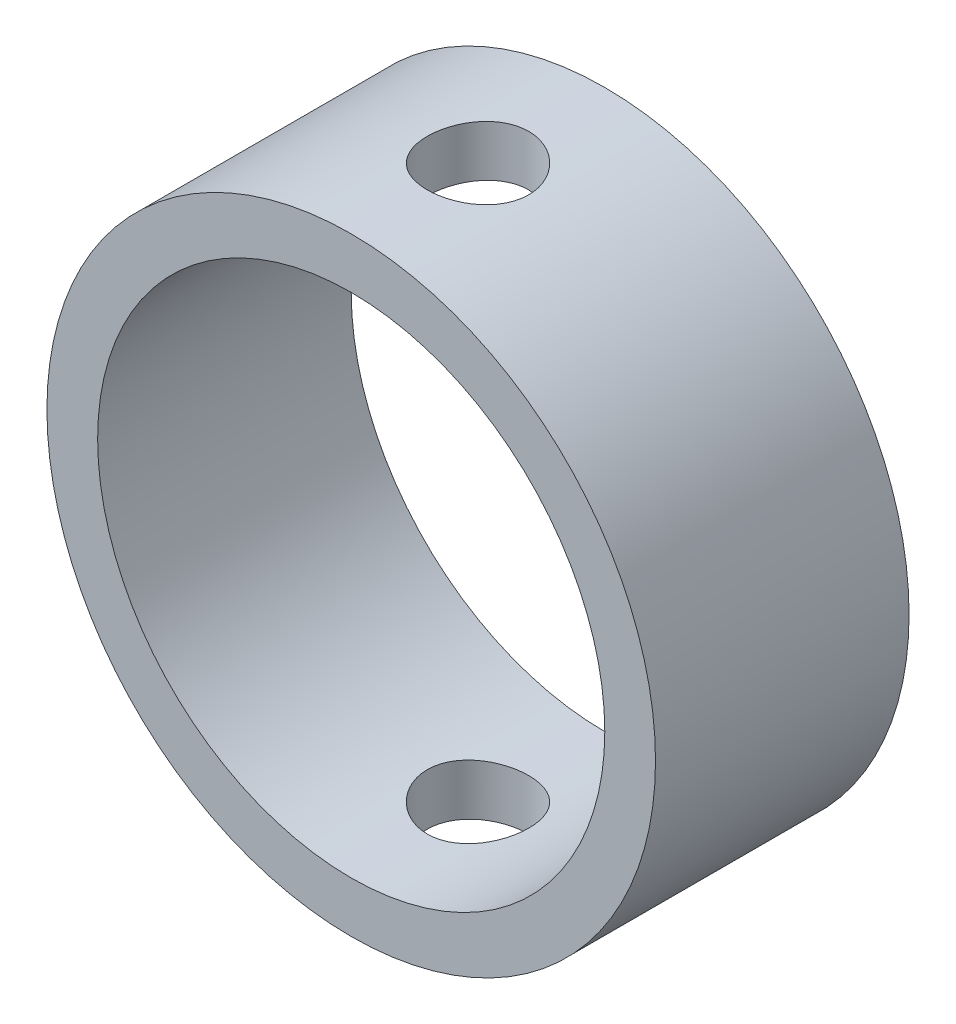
ISO-10303-21;
HEADER;
FILE_DESCRIPTION(('STEP AP214'),'2;1');
FILE_NAME('part.step','',(''),(''),'','','');
FILE_SCHEMA(('AUTOMOTIVE_DESIGN { 1 0 10303 214 1 1 1 1 }'));
ENDSEC;
DATA;
#1=APPLICATION_CONTEXT('core data for automotive mechanical design processes');
#2=APPLICATION_PROTOCOL_DEFINITION('international standard','automotive_design',2000,#1);
#3=PRODUCT_CONTEXT('',#1,'mechanical');
#4=PRODUCT('Part','Part','',(#3));
#5=PRODUCT_RELATED_PRODUCT_CATEGORY('part','',(#4));
#6=PRODUCT_DEFINITION_FORMATION('','',#4);
#7=PRODUCT_DEFINITION_CONTEXT('part definition',#1,'design');
#8=PRODUCT_DEFINITION('design','',#6,#7);
#9=PRODUCT_DEFINITION_SHAPE('','',#8);
#10=(LENGTH_UNIT() NAMED_UNIT(*) SI_UNIT(.MILLI.,.METRE.));
#11=(NAMED_UNIT(*) PLANE_ANGLE_UNIT() SI_UNIT($,.RADIAN.));
#12=(NAMED_UNIT(*) SI_UNIT($,.STERADIAN.) SOLID_ANGLE_UNIT());
#13=UNCERTAINTY_MEASURE_WITH_UNIT(LENGTH_MEASURE(1.E-05),#10,'distance_accuracy_value','');
#14=(GEOMETRIC_REPRESENTATION_CONTEXT(3) GLOBAL_UNCERTAINTY_ASSIGNED_CONTEXT((#13)) GLOBAL_UNIT_ASSIGNED_CONTEXT((#10,
#11,#12)) REPRESENTATION_CONTEXT('',''));
#15=CARTESIAN_POINT('',(0.,0.,0.));
#16=DIRECTION('',(0.,0.,1.));
#17=DIRECTION('',(1.,0.,0.));
#18=AXIS2_PLACEMENT_3D('',#15,#16,#17);
#19=CARTESIAN_POINT('',(0.,0.,5.));
#20=DIRECTION('',(0.,0.,-1.));
#21=DIRECTION('',(-1.,0.,0.));
#22=AXIS2_PLACEMENT_3D('',#19,#20,#21);
#23=CYLINDRICAL_SURFACE('',#22,6.);
#24=CARTESIAN_POINT('',(0.,-6.,3.5));
#25=CARTESIAN_POINT('',(0.0557563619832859,-5.9999990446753,3.49999776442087));
#26=CARTESIAN_POINT('',(0.111543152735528,-5.99921471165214,3.49532109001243));
#27=CARTESIAN_POINT('',(0.221552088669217,-5.99616137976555,3.47674573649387));
#28=CARTESIAN_POINT('',(0.275772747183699,-5.99389101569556,3.46283857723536));
#29=CARTESIAN_POINT('',(0.381041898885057,-5.9881202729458,3.4262338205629));
#30=CARTESIAN_POINT('',(0.43209294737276,-5.98462090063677,3.40354341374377));
#31=CARTESIAN_POINT('',(0.529656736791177,-5.97677690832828,3.35003508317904));
#32=CARTESIAN_POINT('',(0.576169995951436,-5.97243238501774,3.3192180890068));
#33=CARTESIAN_POINT('',(0.663789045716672,-5.96333326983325,3.25001796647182));
#34=CARTESIAN_POINT('',(0.704845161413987,-5.95857548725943,3.21157235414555));
#35=CARTESIAN_POINT('',(0.779955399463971,-5.94921050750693,3.12834081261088));
#36=CARTESIAN_POINT('',(0.814009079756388,-5.94460331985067,3.08355448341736));
#37=CARTESIAN_POINT('',(0.874346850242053,-5.93603026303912,2.98857161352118));
#38=CARTESIAN_POINT('',(0.900581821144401,-5.93206851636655,2.9383434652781));
#39=CARTESIAN_POINT('',(0.944223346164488,-5.9252791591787,2.83411617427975));
#40=CARTESIAN_POINT('',(0.961630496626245,-5.92245147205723,2.78011728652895));
#41=CARTESIAN_POINT('',(0.986965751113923,-5.91828214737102,2.67040789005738));
#42=CARTESIAN_POINT('',(0.994979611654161,-5.9169270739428,2.61471770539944));
#43=CARTESIAN_POINT('',(1.00156669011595,-5.9158157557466,2.50276788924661));
#44=CARTESIAN_POINT('',(1.0001405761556,-5.91605939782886,2.44650829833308));
#45=CARTESIAN_POINT('',(0.987958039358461,-5.91810571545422,2.33562885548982));
#46=CARTESIAN_POINT('',(0.977297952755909,-5.91989229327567,2.28099807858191));
#47=CARTESIAN_POINT('',(0.947101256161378,-5.92479798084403,2.17431147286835));
#48=CARTESIAN_POINT('',(0.927564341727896,-5.92791713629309,2.12225573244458));
#49=CARTESIAN_POINT('',(0.880070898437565,-5.9351539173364,2.02190847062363));
#50=CARTESIAN_POINT('',(0.852074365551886,-5.9392762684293,1.97363623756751));
#51=CARTESIAN_POINT('',(0.788484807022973,-5.94805167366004,1.88243823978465));
#52=CARTESIAN_POINT('',(0.752891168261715,-5.95270477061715,1.83951290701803));
#53=CARTESIAN_POINT('',(0.674592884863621,-5.96208811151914,1.75966956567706));
#54=CARTESIAN_POINT('',(0.631805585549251,-5.96681859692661,1.72283259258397));
#55=CARTESIAN_POINT('',(0.540614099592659,-5.97577040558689,1.65684889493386));
#56=CARTESIAN_POINT('',(0.492209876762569,-5.97999172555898,1.62770221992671));
#57=CARTESIAN_POINT('',(0.391082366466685,-5.98745557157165,1.57791910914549));
#58=CARTESIAN_POINT('',(0.338355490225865,-5.99069727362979,1.5572898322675));
#59=CARTESIAN_POINT('',(0.230119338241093,-5.99583001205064,1.52520231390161));
#60=CARTESIAN_POINT('',(0.174610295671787,-5.9977211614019,1.51374330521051));
#61=CARTESIAN_POINT('',(0.0630839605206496,-5.99992451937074,1.50043145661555));
#62=CARTESIAN_POINT('',(0.00708029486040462,-6.00025501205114,1.49846737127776));
#63=CARTESIAN_POINT('',(-0.104455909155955,-5.99934989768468,1.50390453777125));
#64=CARTESIAN_POINT('',(-0.159988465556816,-5.99811435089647,1.51130542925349));
#65=CARTESIAN_POINT('',(-0.268662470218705,-5.99422730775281,1.53516993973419));
#66=CARTESIAN_POINT('',(-0.321816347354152,-5.99158441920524,1.55157848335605));
#67=CARTESIAN_POINT('',(-0.424618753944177,-5.98517785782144,1.59293380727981));
#68=CARTESIAN_POINT('',(-0.474267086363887,-5.98141412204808,1.61788106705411));
#69=CARTESIAN_POINT('',(-0.569132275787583,-5.97313806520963,1.67586044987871));
#70=CARTESIAN_POINT('',(-0.614306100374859,-5.96861942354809,1.7089620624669));
#71=CARTESIAN_POINT('',(-0.698497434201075,-5.9593538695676,1.78221492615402));
#72=CARTESIAN_POINT('',(-0.737514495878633,-5.95460694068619,1.82236668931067));
#73=CARTESIAN_POINT('',(-0.8086971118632,-5.94536070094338,1.90907901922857));
#74=CARTESIAN_POINT('',(-0.840787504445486,-5.94086446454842,1.95570166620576));
#75=CARTESIAN_POINT('',(-0.896680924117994,-5.93268611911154,2.05374118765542));
#76=CARTESIAN_POINT('',(-0.920484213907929,-5.92900398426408,2.105157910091));
#77=CARTESIAN_POINT('',(-0.959015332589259,-5.92289381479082,2.21111589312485));
#78=CARTESIAN_POINT('',(-0.973780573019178,-5.92046061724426,2.2656432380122));
#79=CARTESIAN_POINT('',(-0.993934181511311,-5.91711086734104,2.3764480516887));
#80=CARTESIAN_POINT('',(-0.999323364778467,-5.91619418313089,2.43272536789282));
#81=CARTESIAN_POINT('',(-1.00054914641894,-5.91598693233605,2.54468206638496));
#82=CARTESIAN_POINT('',(-0.996504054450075,-5.9166762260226,2.60036015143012));
#83=CARTESIAN_POINT('',(-0.979231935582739,-5.91955912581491,2.71023169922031));
#84=CARTESIAN_POINT('',(-0.96600493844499,-5.92175272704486,2.76442516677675));
#85=CARTESIAN_POINT('',(-0.93078979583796,-5.92738942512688,2.86974337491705));
#86=CARTESIAN_POINT('',(-0.908811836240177,-5.93083106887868,2.92087160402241));
#87=CARTESIAN_POINT('',(-0.856730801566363,-5.93857747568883,3.01873426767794));
#88=CARTESIAN_POINT('',(-0.826627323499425,-5.9428822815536,3.06546848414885));
#89=CARTESIAN_POINT('',(-0.758727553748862,-5.95193381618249,3.1538142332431));
#90=CARTESIAN_POINT('',(-0.720844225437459,-5.95668518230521,3.19535840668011));
#91=CARTESIAN_POINT('',(-0.638643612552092,-5.96605748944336,3.27154064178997));
#92=CARTESIAN_POINT('',(-0.594324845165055,-5.97067840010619,3.30617710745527));
#93=CARTESIAN_POINT('',(-0.500147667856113,-5.97930611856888,3.36777930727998));
#94=CARTESIAN_POINT('',(-0.450253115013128,-5.98330846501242,3.39469041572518));
#95=CARTESIAN_POINT('',(-0.346605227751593,-5.9902046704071,3.43970779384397));
#96=CARTESIAN_POINT('',(-0.292855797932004,-5.99309963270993,3.45782283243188));
#97=CARTESIAN_POINT('',(-0.199081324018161,-5.99682316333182,3.48080210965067));
#98=CARTESIAN_POINT('',(-0.15962353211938,-5.99800810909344,3.48798978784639));
#99=CARTESIAN_POINT('',(-0.0801157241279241,-5.99959686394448,3.4975894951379));
#100=CARTESIAN_POINT('',(-0.0400657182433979,-6.00000068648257,3.50000160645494));
#101=CARTESIAN_POINT('',(0.,-6.,3.5));
#102=B_SPLINE_CURVE_WITH_KNOTS('',3,(#24,#25,#26,#27,#28,#29,#30,#31,#32,#33,#34,#35,#36,#37,
#38,#39,#40,#41,#42,#43,#44,#45,#46,#47,#48,#49,#50,#51,#52,#53,#54,#55,#56,#57,#58,#59,#60,#61,
#62,#63,#64,#65,#66,#67,#68,#69,#70,#71,#72,#73,#74,#75,#76,#77,#78,#79,#80,#81,#82,#83,#84,#85,
#86,#87,#88,#89,#90,#91,#92,#93,#94,#95,#96,#97,#98,#99,#100,#101),.UNSPECIFIED.,.T.,.F.,(4,2,2,
2,2,2,2,2,2,2,2,2,2,2,2,2,2,2,2,2,2,2,2,2,2,2,2,2,2,2,2,2,2,2,2,2,2,2,4),(0.,0.167122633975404,
0.334399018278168,0.501538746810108,0.668659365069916,0.837209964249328,1.00577120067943,
1.17537008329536,1.34495750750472,1.51298430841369,1.68099921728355,1.84728208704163,
2.01357066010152,2.18065822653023,2.34775928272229,2.51693107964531,2.68610396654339,
2.85541875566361,3.02471937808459,3.19203153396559,3.35933725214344,3.52563122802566,
3.69193454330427,3.85970730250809,4.02749225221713,4.19701528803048,4.36653294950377,
4.53534408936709,4.70414055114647,4.8708316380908,5.03752218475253,5.20401927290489,
5.37052462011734,5.53900553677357,5.70752533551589,5.8772089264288,6.04672300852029,
6.16681699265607,6.28690890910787),.UNSPECIFIED.);
#103=CARTESIAN_POINT('',(0.,-6.,3.5));
#104=VERTEX_POINT('',#103);
#105=EDGE_CURVE('E68',#104,#104,#102,.T.);
#106=ORIENTED_EDGE('',*,*,#105,.T.);
#107=EDGE_LOOP('',(#106));
#108=FACE_BOUND('',#107,.T.);
#109=CARTESIAN_POINT('',(0.,6.,3.5));
#110=CARTESIAN_POINT('',(-0.0557563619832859,5.9999990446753,3.49999776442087));
#111=CARTESIAN_POINT('',(-0.111543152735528,5.99921471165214,3.49532109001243));
#112=CARTESIAN_POINT('',(-0.221552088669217,5.99616137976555,3.47674573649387));
#113=CARTESIAN_POINT('',(-0.275772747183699,5.99389101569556,3.46283857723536));
#114=CARTESIAN_POINT('',(-0.381041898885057,5.9881202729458,3.4262338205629));
#115=CARTESIAN_POINT('',(-0.43209294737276,5.98462090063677,3.40354341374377));
#116=CARTESIAN_POINT('',(-0.529656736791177,5.97677690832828,3.35003508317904));
#117=CARTESIAN_POINT('',(-0.576169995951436,5.97243238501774,3.3192180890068));
#118=CARTESIAN_POINT('',(-0.663789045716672,5.96333326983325,3.25001796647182));
#119=CARTESIAN_POINT('',(-0.704845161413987,5.95857548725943,3.21157235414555));
#120=CARTESIAN_POINT('',(-0.779955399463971,5.94921050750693,3.12834081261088));
#121=CARTESIAN_POINT('',(-0.814009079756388,5.94460331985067,3.08355448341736));
#122=CARTESIAN_POINT('',(-0.874346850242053,5.93603026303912,2.98857161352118));
#123=CARTESIAN_POINT('',(-0.900581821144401,5.93206851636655,2.9383434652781));
#124=CARTESIAN_POINT('',(-0.944223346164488,5.9252791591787,2.83411617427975));
#125=CARTESIAN_POINT('',(-0.961630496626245,5.92245147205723,2.78011728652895));
#126=CARTESIAN_POINT('',(-0.986965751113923,5.91828214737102,2.67040789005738));
#127=CARTESIAN_POINT('',(-0.994979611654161,5.9169270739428,2.61471770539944));
#128=CARTESIAN_POINT('',(-1.00156669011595,5.9158157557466,2.50276788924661));
#129=CARTESIAN_POINT('',(-1.0001405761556,5.91605939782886,2.44650829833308));
#130=CARTESIAN_POINT('',(-0.987958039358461,5.91810571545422,2.33562885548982));
#131=CARTESIAN_POINT('',(-0.977297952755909,5.91989229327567,2.28099807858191));
#132=CARTESIAN_POINT('',(-0.947101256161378,5.92479798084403,2.17431147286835));
#133=CARTESIAN_POINT('',(-0.927564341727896,5.92791713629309,2.12225573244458));
#134=CARTESIAN_POINT('',(-0.880070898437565,5.9351539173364,2.02190847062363));
#135=CARTESIAN_POINT('',(-0.852074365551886,5.9392762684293,1.97363623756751));
#136=CARTESIAN_POINT('',(-0.788484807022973,5.94805167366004,1.88243823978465));
#137=CARTESIAN_POINT('',(-0.752891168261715,5.95270477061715,1.83951290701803));
#138=CARTESIAN_POINT('',(-0.674592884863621,5.96208811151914,1.75966956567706));
#139=CARTESIAN_POINT('',(-0.631805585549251,5.96681859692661,1.72283259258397));
#140=CARTESIAN_POINT('',(-0.540614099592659,5.97577040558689,1.65684889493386));
#141=CARTESIAN_POINT('',(-0.492209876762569,5.97999172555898,1.62770221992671));
#142=CARTESIAN_POINT('',(-0.391082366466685,5.98745557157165,1.57791910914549));
#143=CARTESIAN_POINT('',(-0.338355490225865,5.99069727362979,1.5572898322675));
#144=CARTESIAN_POINT('',(-0.230119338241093,5.99583001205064,1.52520231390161));
#145=CARTESIAN_POINT('',(-0.174610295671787,5.9977211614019,1.51374330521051));
#146=CARTESIAN_POINT('',(-0.0630839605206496,5.99992451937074,1.50043145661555));
#147=CARTESIAN_POINT('',(-0.00708029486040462,6.00025501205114,1.49846737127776));
#148=CARTESIAN_POINT('',(0.104455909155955,5.99934989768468,1.50390453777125));
#149=CARTESIAN_POINT('',(0.159988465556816,5.99811435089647,1.51130542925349));
#150=CARTESIAN_POINT('',(0.268662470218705,5.99422730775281,1.53516993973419));
#151=CARTESIAN_POINT('',(0.321816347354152,5.99158441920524,1.55157848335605));
#152=CARTESIAN_POINT('',(0.424618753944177,5.98517785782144,1.59293380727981));
#153=CARTESIAN_POINT('',(0.474267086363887,5.98141412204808,1.61788106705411));
#154=CARTESIAN_POINT('',(0.569132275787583,5.97313806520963,1.67586044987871));
#155=CARTESIAN_POINT('',(0.614306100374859,5.96861942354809,1.7089620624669));
#156=CARTESIAN_POINT('',(0.698497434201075,5.9593538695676,1.78221492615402));
#157=CARTESIAN_POINT('',(0.737514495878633,5.95460694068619,1.82236668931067));
#158=CARTESIAN_POINT('',(0.8086971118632,5.94536070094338,1.90907901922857));
#159=CARTESIAN_POINT('',(0.840787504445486,5.94086446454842,1.95570166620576));
#160=CARTESIAN_POINT('',(0.896680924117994,5.93268611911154,2.05374118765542));
#161=CARTESIAN_POINT('',(0.920484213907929,5.92900398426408,2.105157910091));
#162=CARTESIAN_POINT('',(0.959015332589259,5.92289381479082,2.21111589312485));
#163=CARTESIAN_POINT('',(0.973780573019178,5.92046061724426,2.2656432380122));
#164=CARTESIAN_POINT('',(0.993934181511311,5.91711086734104,2.3764480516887));
#165=CARTESIAN_POINT('',(0.999323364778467,5.91619418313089,2.43272536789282));
#166=CARTESIAN_POINT('',(1.00054914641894,5.91598693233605,2.54468206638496));
#167=CARTESIAN_POINT('',(0.996504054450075,5.9166762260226,2.60036015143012));
#168=CARTESIAN_POINT('',(0.979231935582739,5.91955912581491,2.71023169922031));
#169=CARTESIAN_POINT('',(0.96600493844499,5.92175272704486,2.76442516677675));
#170=CARTESIAN_POINT('',(0.93078979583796,5.92738942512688,2.86974337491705));
#171=CARTESIAN_POINT('',(0.908811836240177,5.93083106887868,2.92087160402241));
#172=CARTESIAN_POINT('',(0.856730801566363,5.93857747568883,3.01873426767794));
#173=CARTESIAN_POINT('',(0.826627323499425,5.9428822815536,3.06546848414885));
#174=CARTESIAN_POINT('',(0.758727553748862,5.95193381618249,3.1538142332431));
#175=CARTESIAN_POINT('',(0.720844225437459,5.95668518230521,3.19535840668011));
#176=CARTESIAN_POINT('',(0.638643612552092,5.96605748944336,3.27154064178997));
#177=CARTESIAN_POINT('',(0.594324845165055,5.97067840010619,3.30617710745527));
#178=CARTESIAN_POINT('',(0.500147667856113,5.97930611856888,3.36777930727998));
#179=CARTESIAN_POINT('',(0.450253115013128,5.98330846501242,3.39469041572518));
#180=CARTESIAN_POINT('',(0.346605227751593,5.9902046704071,3.43970779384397));
#181=CARTESIAN_POINT('',(0.292855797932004,5.99309963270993,3.45782283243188));
#182=CARTESIAN_POINT('',(0.199081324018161,5.99682316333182,3.48080210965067));
#183=CARTESIAN_POINT('',(0.15962353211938,5.99800810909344,3.48798978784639));
#184=CARTESIAN_POINT('',(0.0801157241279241,5.99959686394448,3.4975894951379));
#185=CARTESIAN_POINT('',(0.0400657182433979,6.00000068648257,3.50000160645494));
#186=CARTESIAN_POINT('',(0.,6.,3.5));
#187=B_SPLINE_CURVE_WITH_KNOTS('',3,(#109,#110,#111,#112,#113,#114,#115,#116,#117,#118,#119,
#120,#121,#122,#123,#124,#125,#126,#127,#128,#129,#130,#131,#132,#133,#134,#135,#136,#137,#138,
#139,#140,#141,#142,#143,#144,#145,#146,#147,#148,#149,#150,#151,#152,#153,#154,#155,#156,#157,
#158,#159,#160,#161,#162,#163,#164,#165,#166,#167,#168,#169,#170,#171,#172,#173,#174,#175,#176,
#177,#178,#179,#180,#181,#182,#183,#184,#185,#186),.UNSPECIFIED.,.T.,.F.,(4,2,2,2,2,2,2,2,2,2,2,
2,2,2,2,2,2,2,2,2,2,2,2,2,2,2,2,2,2,2,2,2,2,2,2,2,2,2,4),(0.,0.167122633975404,
0.334399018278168,0.501538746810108,0.668659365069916,0.837209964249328,1.00577120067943,
1.17537008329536,1.34495750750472,1.51298430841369,1.68099921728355,1.84728208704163,
2.01357066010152,2.18065822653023,2.34775928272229,2.51693107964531,2.68610396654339,
2.85541875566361,3.02471937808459,3.19203153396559,3.35933725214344,3.52563122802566,
3.69193454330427,3.85970730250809,4.02749225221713,4.19701528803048,4.36653294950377,
4.53534408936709,4.70414055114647,4.8708316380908,5.03752218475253,5.20401927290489,
5.37052462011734,5.53900553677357,5.70752533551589,5.8772089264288,6.04672300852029,
6.16681699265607,6.28690890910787),.UNSPECIFIED.);
#188=CARTESIAN_POINT('',(0.,6.,3.5));
#189=VERTEX_POINT('',#188);
#190=EDGE_CURVE('E64',#189,#189,#187,.T.);
#191=ORIENTED_EDGE('',*,*,#190,.T.);
#192=EDGE_LOOP('',(#191));
#193=FACE_BOUND('',#192,.T.);
#194=CARTESIAN_POINT('',(0.,0.,5.));
#195=DIRECTION('',(0.,0.,1.));
#196=DIRECTION('',(1.,0.,0.));
#197=AXIS2_PLACEMENT_3D('',#194,#195,#196);
#198=CIRCLE('',#197,6.);
#199=CARTESIAN_POINT('',(6.,0.,5.));
#200=VERTEX_POINT('',#199);
#201=EDGE_CURVE('E10',#200,#200,#198,.T.);
#202=ORIENTED_EDGE('',*,*,#201,.F.);
#203=EDGE_LOOP('',(#202));
#204=FACE_BOUND('',#203,.T.);
#205=CARTESIAN_POINT('',(0.,0.,0.));
#206=DIRECTION('',(0.,0.,1.));
#207=DIRECTION('',(1.,0.,0.));
#208=AXIS2_PLACEMENT_3D('',#205,#206,#207);
#209=CIRCLE('',#208,6.);
#210=CARTESIAN_POINT('',(6.,0.,0.));
#211=VERTEX_POINT('',#210);
#212=EDGE_CURVE('E39',#211,#211,#209,.T.);
#213=ORIENTED_EDGE('',*,*,#212,.T.);
#214=EDGE_LOOP('',(#213));
#215=FACE_BOUND('',#214,.T.);
#216=ADVANCED_FACE('F27',(#108,#193,#204,#215),#23,.T.);
#217=CARTESIAN_POINT('',(0.,0.,5.));
#218=DIRECTION('',(0.,0.,1.));
#219=DIRECTION('',(1.,0.,0.));
#220=AXIS2_PLACEMENT_3D('',#217,#218,#219);
#221=PLANE('',#220);
#222=CARTESIAN_POINT('',(0.,0.,5.));
#223=DIRECTION('',(0.,0.,1.));
#224=DIRECTION('',(1.,0.,0.));
#225=AXIS2_PLACEMENT_3D('',#222,#223,#224);
#226=CIRCLE('',#225,5.);
#227=CARTESIAN_POINT('',(5.,0.,5.));
#228=VERTEX_POINT('',#227);
#229=EDGE_CURVE('E73',#228,#228,#226,.T.);
#230=ORIENTED_EDGE('',*,*,#229,.F.);
#231=EDGE_LOOP('',(#230));
#232=FACE_BOUND('',#231,.T.);
#233=ORIENTED_EDGE('',*,*,#201,.T.);
#234=EDGE_LOOP('',(#233));
#235=FACE_BOUND('',#234,.T.);
#236=ADVANCED_FACE('F86',(#232,#235),#221,.T.);
#237=CARTESIAN_POINT('',(0.,0.,0.));
#238=DIRECTION('',(0.,0.,1.));
#239=DIRECTION('',(1.,0.,0.));
#240=AXIS2_PLACEMENT_3D('',#237,#238,#239);
#241=PLANE('',#240);
#242=CARTESIAN_POINT('',(0.,0.,0.));
#243=DIRECTION('',(0.,0.,1.));
#244=DIRECTION('',(1.,0.,0.));
#245=AXIS2_PLACEMENT_3D('',#242,#243,#244);
#246=CIRCLE('',#245,5.);
#247=CARTESIAN_POINT('',(5.,0.,0.));
#248=VERTEX_POINT('',#247);
#249=EDGE_CURVE('E44',#248,#248,#246,.T.);
#250=ORIENTED_EDGE('',*,*,#249,.T.);
#251=EDGE_LOOP('',(#250));
#252=FACE_BOUND('',#251,.T.);
#253=ORIENTED_EDGE('',*,*,#212,.F.);
#254=EDGE_LOOP('',(#253));
#255=FACE_BOUND('',#254,.T.);
#256=ADVANCED_FACE('F78',(#252,#255),#241,.F.);
#257=CARTESIAN_POINT('',(0.,0.,0.));
#258=DIRECTION('',(0.,0.,1.));
#259=DIRECTION('',(1.,0.,0.));
#260=AXIS2_PLACEMENT_3D('',#257,#258,#259);
#261=CYLINDRICAL_SURFACE('',#260,5.);
#262=CARTESIAN_POINT('',(0.,-5.,3.5));
#263=CARTESIAN_POINT('',(-0.0555769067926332,-4.99999897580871,3.49999795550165));
#264=CARTESIAN_POINT('',(-0.111179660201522,-4.99906385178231,3.49535115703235));
#265=CARTESIAN_POINT('',(-0.220813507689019,-4.99542365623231,3.47690149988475));
#266=CARTESIAN_POINT('',(-0.274843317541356,-4.99271717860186,3.46309136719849));
#267=CARTESIAN_POINT('',(-0.379730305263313,-4.98583649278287,3.42675872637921));
#268=CARTESIAN_POINT('',(-0.430590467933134,-4.98166369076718,3.40424456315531));
#269=CARTESIAN_POINT('',(-0.527807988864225,-4.97230398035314,3.35116775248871));
#270=CARTESIAN_POINT('',(-0.574165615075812,-4.96711713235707,3.3206055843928));
#271=CARTESIAN_POINT('',(-0.661693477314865,-4.9562216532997,3.25186150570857));
#272=CARTESIAN_POINT('',(-0.702793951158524,-4.95050745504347,3.2135916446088));
#273=CARTESIAN_POINT('',(-0.778036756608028,-4.93924180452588,3.1307075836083));
#274=CARTESIAN_POINT('',(-0.812178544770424,-4.93369036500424,3.08609288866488));
#275=CARTESIAN_POINT('',(-0.87283175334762,-4.92332441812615,2.99128380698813));
#276=CARTESIAN_POINT('',(-0.899270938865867,-4.91851707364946,2.94104235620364));
#277=CARTESIAN_POINT('',(-0.943305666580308,-4.91026268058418,2.83671818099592));
#278=CARTESIAN_POINT('',(-0.960902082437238,-4.90681549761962,2.78263583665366));
#279=CARTESIAN_POINT('',(-0.986525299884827,-4.90172805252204,2.67291563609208));
#280=CARTESIAN_POINT('',(-0.994674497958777,-4.90006470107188,2.61730745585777));
#281=CARTESIAN_POINT('',(-1.00155212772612,-4.89866375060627,2.50549017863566));
#282=CARTESIAN_POINT('',(-1.0002815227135,-4.89892595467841,2.44928114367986));
#283=CARTESIAN_POINT('',(-0.988454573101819,-4.90132551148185,2.338753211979));
#284=CARTESIAN_POINT('',(-0.978038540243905,-4.90343452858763,2.28441859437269));
#285=CARTESIAN_POINT('',(-0.94843788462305,-4.90924546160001,2.178283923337));
#286=CARTESIAN_POINT('',(-0.929252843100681,-4.91294745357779,2.12648399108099));
#287=CARTESIAN_POINT('',(-0.88252478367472,-4.92155618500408,2.0264847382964));
#288=CARTESIAN_POINT('',(-0.854926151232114,-4.92647089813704,1.97831212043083));
#289=CARTESIAN_POINT('',(-0.792193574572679,-4.93694618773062,1.88722915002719));
#290=CARTESIAN_POINT('',(-0.757058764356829,-4.94250683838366,1.84431940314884));
#291=CARTESIAN_POINT('',(-0.679499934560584,-4.95377021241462,1.76417059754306));
#292=CARTESIAN_POINT('',(-0.636956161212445,-4.95947369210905,1.72704743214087));
#293=CARTESIAN_POINT('',(-0.54618502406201,-4.97028848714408,1.66044615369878));
#294=CARTESIAN_POINT('',(-0.497957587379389,-4.97539979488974,1.63096813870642));
#295=CARTESIAN_POINT('',(-0.397059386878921,-4.98446690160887,1.58047249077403));
#296=CARTESIAN_POINT('',(-0.3443818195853,-4.98842088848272,1.55946810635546));
#297=CARTESIAN_POINT('',(-0.236148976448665,-4.99471408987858,1.52663952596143));
#298=CARTESIAN_POINT('',(-0.18059405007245,-4.99705350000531,1.51481421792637));
#299=CARTESIAN_POINT('',(-0.0691794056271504,-4.99982671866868,1.50084354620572));
#300=CARTESIAN_POINT('',(-0.0133403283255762,-5.0002917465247,1.49853958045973));
#301=CARTESIAN_POINT('',(0.0979249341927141,-4.99935051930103,1.50324985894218));
#302=CARTESIAN_POINT('',(0.153351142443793,-4.99794436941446,1.5102635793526));
#303=CARTESIAN_POINT('',(0.261705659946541,-4.99343832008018,1.53327837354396));
#304=CARTESIAN_POINT('',(0.314651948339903,-4.99035376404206,1.5491980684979));
#305=CARTESIAN_POINT('',(0.417123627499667,-4.98283552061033,1.58948398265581));
#306=CARTESIAN_POINT('',(0.466648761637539,-4.97840173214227,1.61385083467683));
#307=CARTESIAN_POINT('',(0.561541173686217,-4.96859911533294,1.67068249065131));
#308=CARTESIAN_POINT('',(0.606850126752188,-4.96321950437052,1.70324278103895));
#309=CARTESIAN_POINT('',(0.691418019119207,-4.95214734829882,1.77540919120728));
#310=CARTESIAN_POINT('',(0.730676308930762,-4.94645476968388,1.81501606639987));
#311=CARTESIAN_POINT('',(0.802640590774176,-4.93529303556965,1.90087335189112));
#312=CARTESIAN_POINT('',(0.835237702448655,-4.92982860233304,1.94721574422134));
#313=CARTESIAN_POINT('',(0.892185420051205,-4.91984191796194,2.04481136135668));
#314=CARTESIAN_POINT('',(0.916536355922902,-4.91531962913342,2.09606438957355));
#315=CARTESIAN_POINT('',(0.95615184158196,-4.90776740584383,2.20176824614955));
#316=CARTESIAN_POINT('',(0.971463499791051,-4.90472974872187,2.25620084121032));
#317=CARTESIAN_POINT('',(0.992708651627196,-4.90047436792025,2.3669334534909));
#318=CARTESIAN_POINT('',(0.998643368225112,-4.89925640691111,2.42323322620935));
#319=CARTESIAN_POINT('',(1.00092091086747,-4.89879149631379,2.53500886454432));
#320=CARTESIAN_POINT('',(0.997435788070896,-4.89950919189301,2.59048114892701));
#321=CARTESIAN_POINT('',(0.981352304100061,-4.90275573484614,2.70003164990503));
#322=CARTESIAN_POINT('',(0.968754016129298,-4.90528456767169,2.7541098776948));
#323=CARTESIAN_POINT('',(0.934878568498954,-4.91185264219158,2.85922771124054));
#324=CARTESIAN_POINT('',(0.913622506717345,-4.9158882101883,2.91027436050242));
#325=CARTESIAN_POINT('',(0.863054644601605,-4.9250171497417,3.00810372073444));
#326=CARTESIAN_POINT('',(0.833742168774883,-4.93011060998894,3.05488607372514));
#327=CARTESIAN_POINT('',(0.767305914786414,-4.94088960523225,3.14371557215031));
#328=CARTESIAN_POINT('',(0.730057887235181,-4.94658372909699,3.1856687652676));
#329=CARTESIAN_POINT('',(0.649064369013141,-4.95786081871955,3.26278620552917));
#330=CARTESIAN_POINT('',(0.605317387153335,-4.96344375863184,3.29794889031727));
#331=CARTESIAN_POINT('',(0.512017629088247,-4.97393832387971,3.36083464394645));
#332=CARTESIAN_POINT('',(0.462408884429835,-4.97884231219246,3.38847600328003));
#333=CARTESIAN_POINT('',(0.359166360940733,-4.98735125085,3.43498612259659));
#334=CARTESIAN_POINT('',(0.305536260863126,-4.99095737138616,3.45386278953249));
#335=CARTESIAN_POINT('',(0.20982148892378,-4.99576372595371,3.47865194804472));
#336=CARTESIAN_POINT('',(0.168281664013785,-4.99734303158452,3.48664319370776));
#337=CARTESIAN_POINT('',(0.0844995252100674,-4.99946154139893,3.49731791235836));
#338=CARTESIAN_POINT('',(0.0422572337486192,-5.00000077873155,3.50000155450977));
#339=CARTESIAN_POINT('',(0.,-5.,3.5));
#340=B_SPLINE_CURVE_WITH_KNOTS('',3,(#262,#263,#264,#265,#266,#267,#268,#269,#270,#271,#272,
#273,#274,#275,#276,#277,#278,#279,#280,#281,#282,#283,#284,#285,#286,#287,#288,#289,#290,#291,
#292,#293,#294,#295,#296,#297,#298,#299,#300,#301,#302,#303,#304,#305,#306,#307,#308,#309,#310,
#311,#312,#313,#314,#315,#316,#317,#318,#319,#320,#321,#322,#323,#324,#325,#326,#327,#328,#329,
#330,#331,#332,#333,#334,#335,#336,#337,#338,#339),.UNSPECIFIED.,.T.,.F.,(4,2,2,2,2,2,2,2,2,2,2,
2,2,2,2,2,2,2,2,2,2,2,2,2,2,2,2,2,2,2,2,2,2,2,2,2,2,2,4),(0.,0.166576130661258,
0.333284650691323,0.499833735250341,0.666372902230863,0.834932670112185,1.00350559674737,
1.17361195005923,1.34370149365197,1.51156185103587,1.67940504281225,1.84471727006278,
2.0100373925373,2.17647490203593,2.3429315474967,2.51238252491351,2.6818356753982,
2.85155274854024,3.02124925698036,3.18810735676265,3.35495607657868,3.52030453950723,
3.68566539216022,3.85305066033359,4.0204538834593,4.19040628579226,4.36035188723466,
4.52940381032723,4.69843368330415,4.86439722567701,5.03035943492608,5.1959196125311,
5.36149367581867,5.52988076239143,5.6983065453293,5.86849496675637,6.03852955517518,
6.16518775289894,6.29184191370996),.UNSPECIFIED.);
#341=CARTESIAN_POINT('',(0.,-5.,3.5));
#342=VERTEX_POINT('',#341);
#343=EDGE_CURVE('E31',#342,#342,#340,.T.);
#344=ORIENTED_EDGE('',*,*,#343,.T.);
#345=EDGE_LOOP('',(#344));
#346=FACE_BOUND('',#345,.T.);
#347=CARTESIAN_POINT('',(0.,5.,3.5));
#348=CARTESIAN_POINT('',(0.0555769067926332,4.99999897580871,3.49999795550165));
#349=CARTESIAN_POINT('',(0.111179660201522,4.99906385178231,3.49535115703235));
#350=CARTESIAN_POINT('',(0.220813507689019,4.99542365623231,3.47690149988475));
#351=CARTESIAN_POINT('',(0.274843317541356,4.99271717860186,3.46309136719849));
#352=CARTESIAN_POINT('',(0.379730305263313,4.98583649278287,3.42675872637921));
#353=CARTESIAN_POINT('',(0.430590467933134,4.98166369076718,3.40424456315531));
#354=CARTESIAN_POINT('',(0.527807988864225,4.97230398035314,3.35116775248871));
#355=CARTESIAN_POINT('',(0.574165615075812,4.96711713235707,3.3206055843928));
#356=CARTESIAN_POINT('',(0.661693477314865,4.9562216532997,3.25186150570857));
#357=CARTESIAN_POINT('',(0.702793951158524,4.95050745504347,3.2135916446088));
#358=CARTESIAN_POINT('',(0.778036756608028,4.93924180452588,3.1307075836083));
#359=CARTESIAN_POINT('',(0.812178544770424,4.93369036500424,3.08609288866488));
#360=CARTESIAN_POINT('',(0.87283175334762,4.92332441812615,2.99128380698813));
#361=CARTESIAN_POINT('',(0.899270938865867,4.91851707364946,2.94104235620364));
#362=CARTESIAN_POINT('',(0.943305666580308,4.91026268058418,2.83671818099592));
#363=CARTESIAN_POINT('',(0.960902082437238,4.90681549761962,2.78263583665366));
#364=CARTESIAN_POINT('',(0.986525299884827,4.90172805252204,2.67291563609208));
#365=CARTESIAN_POINT('',(0.994674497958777,4.90006470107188,2.61730745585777));
#366=CARTESIAN_POINT('',(1.00155212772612,4.89866375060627,2.50549017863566));
#367=CARTESIAN_POINT('',(1.0002815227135,4.89892595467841,2.44928114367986));
#368=CARTESIAN_POINT('',(0.988454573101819,4.90132551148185,2.338753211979));
#369=CARTESIAN_POINT('',(0.978038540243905,4.90343452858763,2.28441859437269));
#370=CARTESIAN_POINT('',(0.94843788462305,4.90924546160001,2.178283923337));
#371=CARTESIAN_POINT('',(0.929252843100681,4.91294745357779,2.12648399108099));
#372=CARTESIAN_POINT('',(0.88252478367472,4.92155618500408,2.0264847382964));
#373=CARTESIAN_POINT('',(0.854926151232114,4.92647089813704,1.97831212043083));
#374=CARTESIAN_POINT('',(0.792193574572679,4.93694618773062,1.88722915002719));
#375=CARTESIAN_POINT('',(0.757058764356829,4.94250683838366,1.84431940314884));
#376=CARTESIAN_POINT('',(0.679499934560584,4.95377021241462,1.76417059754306));
#377=CARTESIAN_POINT('',(0.636956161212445,4.95947369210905,1.72704743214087));
#378=CARTESIAN_POINT('',(0.54618502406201,4.97028848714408,1.66044615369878));
#379=CARTESIAN_POINT('',(0.497957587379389,4.97539979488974,1.63096813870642));
#380=CARTESIAN_POINT('',(0.397059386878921,4.98446690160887,1.58047249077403));
#381=CARTESIAN_POINT('',(0.3443818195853,4.98842088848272,1.55946810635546));
#382=CARTESIAN_POINT('',(0.236148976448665,4.99471408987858,1.52663952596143));
#383=CARTESIAN_POINT('',(0.18059405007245,4.99705350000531,1.51481421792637));
#384=CARTESIAN_POINT('',(0.0691794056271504,4.99982671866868,1.50084354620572));
#385=CARTESIAN_POINT('',(0.0133403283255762,5.0002917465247,1.49853958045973));
#386=CARTESIAN_POINT('',(-0.0979249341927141,4.99935051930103,1.50324985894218));
#387=CARTESIAN_POINT('',(-0.153351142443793,4.99794436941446,1.5102635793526));
#388=CARTESIAN_POINT('',(-0.261705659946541,4.99343832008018,1.53327837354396));
#389=CARTESIAN_POINT('',(-0.314651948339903,4.99035376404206,1.5491980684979));
#390=CARTESIAN_POINT('',(-0.417123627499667,4.98283552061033,1.58948398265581));
#391=CARTESIAN_POINT('',(-0.466648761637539,4.97840173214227,1.61385083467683));
#392=CARTESIAN_POINT('',(-0.561541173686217,4.96859911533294,1.67068249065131));
#393=CARTESIAN_POINT('',(-0.606850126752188,4.96321950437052,1.70324278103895));
#394=CARTESIAN_POINT('',(-0.691418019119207,4.95214734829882,1.77540919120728));
#395=CARTESIAN_POINT('',(-0.730676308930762,4.94645476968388,1.81501606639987));
#396=CARTESIAN_POINT('',(-0.802640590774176,4.93529303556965,1.90087335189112));
#397=CARTESIAN_POINT('',(-0.835237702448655,4.92982860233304,1.94721574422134));
#398=CARTESIAN_POINT('',(-0.892185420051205,4.91984191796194,2.04481136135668));
#399=CARTESIAN_POINT('',(-0.916536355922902,4.91531962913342,2.09606438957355));
#400=CARTESIAN_POINT('',(-0.95615184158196,4.90776740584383,2.20176824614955));
#401=CARTESIAN_POINT('',(-0.971463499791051,4.90472974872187,2.25620084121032));
#402=CARTESIAN_POINT('',(-0.992708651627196,4.90047436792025,2.3669334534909));
#403=CARTESIAN_POINT('',(-0.998643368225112,4.89925640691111,2.42323322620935));
#404=CARTESIAN_POINT('',(-1.00092091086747,4.89879149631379,2.53500886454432));
#405=CARTESIAN_POINT('',(-0.997435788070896,4.89950919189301,2.59048114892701));
#406=CARTESIAN_POINT('',(-0.981352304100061,4.90275573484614,2.70003164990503));
#407=CARTESIAN_POINT('',(-0.968754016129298,4.90528456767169,2.7541098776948));
#408=CARTESIAN_POINT('',(-0.934878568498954,4.91185264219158,2.85922771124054));
#409=CARTESIAN_POINT('',(-0.913622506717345,4.9158882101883,2.91027436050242));
#410=CARTESIAN_POINT('',(-0.863054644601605,4.9250171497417,3.00810372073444));
#411=CARTESIAN_POINT('',(-0.833742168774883,4.93011060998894,3.05488607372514));
#412=CARTESIAN_POINT('',(-0.767305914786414,4.94088960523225,3.14371557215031));
#413=CARTESIAN_POINT('',(-0.730057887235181,4.94658372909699,3.1856687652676));
#414=CARTESIAN_POINT('',(-0.649064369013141,4.95786081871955,3.26278620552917));
#415=CARTESIAN_POINT('',(-0.605317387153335,4.96344375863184,3.29794889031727));
#416=CARTESIAN_POINT('',(-0.512017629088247,4.97393832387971,3.36083464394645));
#417=CARTESIAN_POINT('',(-0.462408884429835,4.97884231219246,3.38847600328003));
#418=CARTESIAN_POINT('',(-0.359166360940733,4.98735125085,3.43498612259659));
#419=CARTESIAN_POINT('',(-0.305536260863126,4.99095737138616,3.45386278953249));
#420=CARTESIAN_POINT('',(-0.20982148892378,4.99576372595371,3.47865194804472));
#421=CARTESIAN_POINT('',(-0.168281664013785,4.99734303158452,3.48664319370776));
#422=CARTESIAN_POINT('',(-0.0844995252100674,4.99946154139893,3.49731791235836));
#423=CARTESIAN_POINT('',(-0.0422572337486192,5.00000077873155,3.50000155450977));
#424=CARTESIAN_POINT('',(0.,5.,3.5));
#425=B_SPLINE_CURVE_WITH_KNOTS('',3,(#347,#348,#349,#350,#351,#352,#353,#354,#355,#356,#357,
#358,#359,#360,#361,#362,#363,#364,#365,#366,#367,#368,#369,#370,#371,#372,#373,#374,#375,#376,
#377,#378,#379,#380,#381,#382,#383,#384,#385,#386,#387,#388,#389,#390,#391,#392,#393,#394,#395,
#396,#397,#398,#399,#400,#401,#402,#403,#404,#405,#406,#407,#408,#409,#410,#411,#412,#413,#414,
#415,#416,#417,#418,#419,#420,#421,#422,#423,#424),.UNSPECIFIED.,.T.,.F.,(4,2,2,2,2,2,2,2,2,2,2,
2,2,2,2,2,2,2,2,2,2,2,2,2,2,2,2,2,2,2,2,2,2,2,2,2,2,2,4),(0.,0.166576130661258,
0.333284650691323,0.499833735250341,0.666372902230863,0.834932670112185,1.00350559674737,
1.17361195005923,1.34370149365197,1.51156185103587,1.67940504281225,1.84471727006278,
2.0100373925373,2.17647490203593,2.3429315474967,2.51238252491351,2.6818356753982,
2.85155274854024,3.02124925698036,3.18810735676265,3.35495607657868,3.52030453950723,
3.68566539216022,3.85305066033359,4.0204538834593,4.19040628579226,4.36035188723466,
4.52940381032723,4.69843368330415,4.86439722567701,5.03035943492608,5.1959196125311,
5.36149367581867,5.52988076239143,5.6983065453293,5.86849496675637,6.03852955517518,
6.16518775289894,6.29184191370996),.UNSPECIFIED.);
#426=CARTESIAN_POINT('',(0.,5.,3.5));
#427=VERTEX_POINT('',#426);
#428=EDGE_CURVE('E47',#427,#427,#425,.T.);
#429=ORIENTED_EDGE('',*,*,#428,.T.);
#430=EDGE_LOOP('',(#429));
#431=FACE_BOUND('',#430,.T.);
#432=ORIENTED_EDGE('',*,*,#249,.F.);
#433=EDGE_LOOP('',(#432));
#434=FACE_BOUND('',#433,.T.);
#435=ORIENTED_EDGE('',*,*,#229,.T.);
#436=EDGE_LOOP('',(#435));
#437=FACE_BOUND('',#436,.T.);
#438=ADVANCED_FACE('F51',(#346,#431,#434,#437),#261,.F.);
#439=CARTESIAN_POINT('',(0.,-10.,2.5));
#440=DIRECTION('',(0.,1.,0.));
#441=DIRECTION('',(0.,0.,1.));
#442=AXIS2_PLACEMENT_3D('',#439,#440,#441);
#443=CYLINDRICAL_SURFACE('',#442,1.);
#444=ORIENTED_EDGE('',*,*,#428,.F.);
#445=EDGE_LOOP('',(#444));
#446=FACE_BOUND('',#445,.T.);
#447=ORIENTED_EDGE('',*,*,#190,.F.);
#448=EDGE_LOOP('',(#447));
#449=FACE_BOUND('',#448,.T.);
#450=ADVANCED_FACE('F57',(#446,#449),#443,.F.);
#451=ORIENTED_EDGE('',*,*,#343,.F.);
#452=EDGE_LOOP('',(#451));
#453=FACE_BOUND('',#452,.T.);
#454=ORIENTED_EDGE('',*,*,#105,.F.);
#455=EDGE_LOOP('',(#454));
#456=FACE_BOUND('',#455,.T.);
#457=ADVANCED_FACE('F54',(#453,#456),#443,.F.);
#458=CLOSED_SHELL('',(#216,#236,#256,#438,#450,#457));
#459=MANIFOLD_SOLID_BREP('B2',#458);
#460=ADVANCED_BREP_SHAPE_REPRESENTATION('',(#18,#459),#14);
#461=SHAPE_DEFINITION_REPRESENTATION(#9,#460);
ENDSEC;
END-ISO-10303-21;
